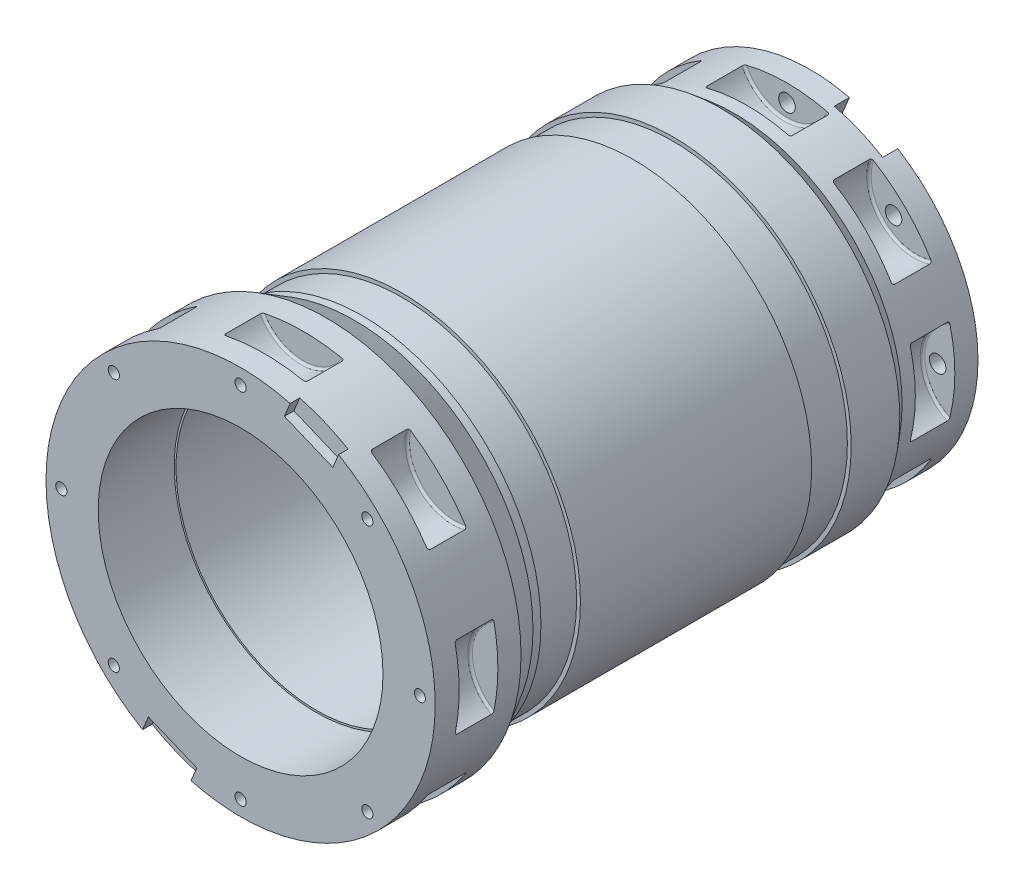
from build123d import *

# Parameters (mm, degrees)
SKETCH3_R                = 31.75
CUT_EXTRUDE1_DEPTH       = 25.908
FILLET3_R                = 1.524
CIRPATTERN1_COUNT        = 8
FILLET3_OF_CIRPATTERN1_R = 1.524
CUT_EXTRUDE2_REACH       = 425.145
SKETCH5_R                = 3.7465
CIRPATTERN2_COUNT        = 8
CUT_EXTRUDE3_DEPTH       = 6.35
SKETCH8_R                = 31.75
CUT_EXTRUDE4_DEPTH       = 26.416
FILLET2_R                = 1.524
CIRPATTERN3_COUNT        = 8
FILLET2_OF_CIRPATTERN3_R = 1.524
CUT_EXTRUDE5_REACH       = 425.145
SKETCH9_R                = 5.5499
CIRPATTERN4_COUNT        = 8
CUT_EXTRUDE6_START       = -10.16
CUT_EXTRUDE6_DEPTH       = 10.16


with BuildPart() as part:
    # Sketch1 → Base-Revolve (revolve)
    with BuildSketch(Plane(origin=(0, 0, 0), x_dir=(0, 0, -1), z_dir=(1, 0, 0)), mode=Mode.PRIVATE) as base_revolve_sk:
        Polygon((-195.964132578, 95.25), (-145.164132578, 95.25), (-145.164132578, 93.98), (74.545867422, 93.98), (74.545867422, 63.5), (84.705867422, 63.5), (84.705867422, 91.881058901), (104.263867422, 91.881058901), (129.917867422, 78.74), (167.255867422, 78.74), (167.255867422, 79.375), (185.035867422, 79.375), (185.035867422, 112.268), (134.235867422, 112.268), (125.599867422, 119.38), (93.087867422, 119.38), (93.087867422, 116.84), (66.671867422, 116.84), (66.671867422, 119.38), (-88.014132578, 119.38), (-88.014132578, 116.84), (-114.430132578, 116.84), (-114.430132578, 119.38), (-119.764132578, 119.38), (-138.560132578, 130.175), (-195.964132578, 130.175), (-195.964132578, 119.38), align=None)
    revolve(base_revolve_sk.sketch.rotate(Axis((0, 0, 113.104705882), (0, 0, -1)), 90), axis=Axis((0, 0, 113.104705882), (0, 0, -1)))

    # Sketch3 → Cut-Extrude1 (cut)
    with BuildSketch(Plane.XY.offset(179.962132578)):
        with Locations((0, 143.2941)):
            Circle(SKETCH3_R)
    cut_extrude1 = extrude(amount=-CUT_EXTRUDE1_DEPTH, mode=Mode.SUBTRACT)

    # Fillet3
    fillet3_edges = [part.edges().sort_by_distance(p)[0] for p in [
        (0, 111.5441, 154.054132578),
        (0, 111.5441, 179.962132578),
    ]]
    fillet(fillet3_edges, radius=FILLET3_R)

    # CirPattern1: Cut-Extrude1 ×8 about axis
    cirpattern1_axis = Axis((0, 0, 0), (0, 0, 1))
    for i in range(1, CIRPATTERN1_COUNT):
        add(cut_extrude1.rotate(cirpattern1_axis, i * 360 / CIRPATTERN1_COUNT), mode=Mode.SUBTRACT)

    # Fillet3 of CirPattern1
    fillet3_of_cirpattern1_edges = [part.edges().sort_by_distance(p)[0] for p in [
        (-78.873589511, 78.873589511, 154.054132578),
        (-78.873589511, 78.873589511, 179.962132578),
        (-111.5441, 0, 154.054132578),
        (-111.5441, 0, 179.962132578),
        (-78.873589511, -78.873589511, 154.054132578),
        (-78.873589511, -78.873589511, 179.962132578),
        (0, -111.5441, 154.054132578),
        (0, -111.5441, 179.962132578),
        (78.873589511, -78.873589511, 154.054132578),
        (78.873589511, -78.873589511, 179.962132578),
        (111.5441, 0, 154.054132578),
        (111.5441, 0, 179.962132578),
        (78.873589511, 78.873589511, 154.054132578),
        (78.873589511, 78.873589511, 179.962132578),
    ]]
    fillet(fillet3_of_cirpattern1_edges, radius=FILLET3_OF_CIRPATTERN1_R)

    # Sketch5 → Cut-Extrude2 (cut, up to next)
    with BuildSketch(Plane.XY.offset(195.964132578), mode=Mode.PRIVATE) as cut_extrude2_sk1:
        with Locations((0, 119.9261)):
            Circle(SKETCH5_R)
    cut_extrude2_tool1 = extrude(cut_extrude2_sk1.sketch, amount=-CUT_EXTRUDE2_REACH, mode=Mode.PRIVATE) & part.part
    cut_extrude2 = cut_extrude2_tool1.solids().sort_by_distance((0, 119.9261, 195.964133))[0]
    add(cut_extrude2, mode=Mode.SUBTRACT)

    # CirPattern2: Cut-Extrude2 ×8 about axis
    cirpattern2_axis = Axis((0, 0, 0), (0, 0, 1))
    for i in range(1, CIRPATTERN2_COUNT):
        add(cut_extrude2.rotate(cirpattern2_axis, i * 360 / CIRPATTERN2_COUNT), mode=Mode.SUBTRACT)

    # Sketch6 → Cut-Extrude3 (cut)
    with BuildSketch(Plane.XY.offset(195.964132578)):
        with BuildLine():
            Line((-65.554174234, -112.464131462), (-61.666110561, -103.077515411))
            Line((-61.666110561, -103.077515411), (-29.282285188, -116.491335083))
            Line((-29.282285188, -116.491335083), (-33.170348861, -125.877951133))
            ThreePointArc((-33.170348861, -125.877951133), (-49.815815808, -120.266018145), (-65.554174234, -112.464131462))
        make_face()
        with BuildLine():
            Line((65.554174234, 112.464131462), (61.666110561, 103.077515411))
            Line((61.666110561, 103.077515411), (29.282285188, 116.491335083))
            Line((29.282285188, 116.491335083), (33.170348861, 125.877951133))
            ThreePointArc((33.170348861, 125.877951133), (49.815815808, 120.266018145), (65.554174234, 112.464131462))
        make_face()
    extrude(amount=-CUT_EXTRUDE3_DEPTH, mode=Mode.SUBTRACT)

    # Sketch8 → Cut-Extrude4 (cut)
    with BuildSketch(Plane(origin=(0, 0, -169.541867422), x_dir=(-1, 0, 0), z_dir=(0, 0, -1))):
        with Locations((0, 122.3772)):
            Circle(SKETCH8_R)
    cut_extrude4 = extrude(amount=-CUT_EXTRUDE4_DEPTH, mode=Mode.SUBTRACT)

    # Fillet2
    fillet2_edges = [part.edges().sort_by_distance(p)[0] for p in [
        (0, 90.6272, -143.125867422),
        (0, 90.6272, -169.541867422),
    ]]
    fillet(fillet2_edges, radius=FILLET2_R)

    # CirPattern3: Cut-Extrude4 ×8 about axis
    cirpattern3_axis = Axis((0, 0, 0), (0, 0, 1))
    for i in range(1, CIRPATTERN3_COUNT):
        add(cut_extrude4.rotate(cirpattern3_axis, i * 360 / CIRPATTERN3_COUNT), mode=Mode.SUBTRACT)

    # Fillet2 of CirPattern3
    fillet2_of_cirpattern3_edges = [part.edges().sort_by_distance(p)[0] for p in [
        (-64.08310768, 64.08310768, -143.125867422),
        (-64.08310768, 64.08310768, -169.541867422),
        (-90.6272, 0, -143.125867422),
        (-90.6272, 0, -169.541867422),
        (-64.08310768, -64.08310768, -143.125867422),
        (-64.08310768, -64.08310768, -169.541867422),
        (0, -90.6272, -143.125867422),
        (0, -90.6272, -169.541867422),
        (64.08310768, -64.08310768, -143.125867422),
        (64.08310768, -64.08310768, -169.541867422),
        (90.6272, 0, -143.125867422),
        (90.6272, 0, -169.541867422),
        (64.08310768, 64.08310768, -143.125867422),
        (64.08310768, 64.08310768, -169.541867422),
    ]]
    fillet(fillet2_of_cirpattern3_edges, radius=FILLET2_OF_CIRPATTERN3_R)

    # Sketch9 → Cut-Extrude5 (cut, up to next)
    with BuildSketch(Plane(origin=(0, 0, -185.035867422), x_dir=(-1, 0, 0), z_dir=(0, 0, -1)), mode=Mode.PRIVATE) as cut_extrude5_sk1:
        with Locations((0, 100.7745)):
            Circle(SKETCH9_R)
    cut_extrude5_tool1 = extrude(cut_extrude5_sk1.sketch, amount=-CUT_EXTRUDE5_REACH, mode=Mode.PRIVATE) & part.part
    cut_extrude5 = cut_extrude5_tool1.solids().sort_by_distance((0, 100.7745, -185.035867))[0]
    add(cut_extrude5, mode=Mode.SUBTRACT)

    # CirPattern4: Cut-Extrude5 ×8 about axis
    cirpattern4_axis = Axis((0, 0, 0), (0, 0, 1))
    for i in range(1, CIRPATTERN4_COUNT):
        add(cut_extrude5.rotate(cirpattern4_axis, i * 360 / CIRPATTERN4_COUNT), mode=Mode.SUBTRACT)

    # Sketch10 → Cut-Extrude6 (cut)
    with BuildSketch(Plane(origin=(0, 0, -185.035867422), x_dir=(-1, 0, 0), z_dir=(0, 0, -1)).offset(CUT_EXTRUDE6_START)):
        with BuildLine():
            Line((-58.628284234, 95.743553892), (-52.698987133, 81.428964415))
            Line((-52.698987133, 81.428964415), (-20.315161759, 94.842784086))
            Line((-20.315161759, 94.842784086), (-26.24445886, 109.157373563))
            ThreePointArc((-26.24445886, 109.157373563), (-42.963103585, 103.722107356), (-58.628284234, 95.743553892))
        make_face()
        with BuildLine():
            Line((58.628284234, -95.743553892), (52.698987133, -81.428964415))
            Line((52.698987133, -81.428964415), (20.315161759, -94.842784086))
            Line((20.315161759, -94.842784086), (26.24445886, -109.157373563))
            ThreePointArc((26.24445886, -109.157373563), (42.963103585, -103.722107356), (58.628284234, -95.743553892))
        make_face()
    extrude(amount=CUT_EXTRUDE6_DEPTH, mode=Mode.SUBTRACT)


solid = part.part
